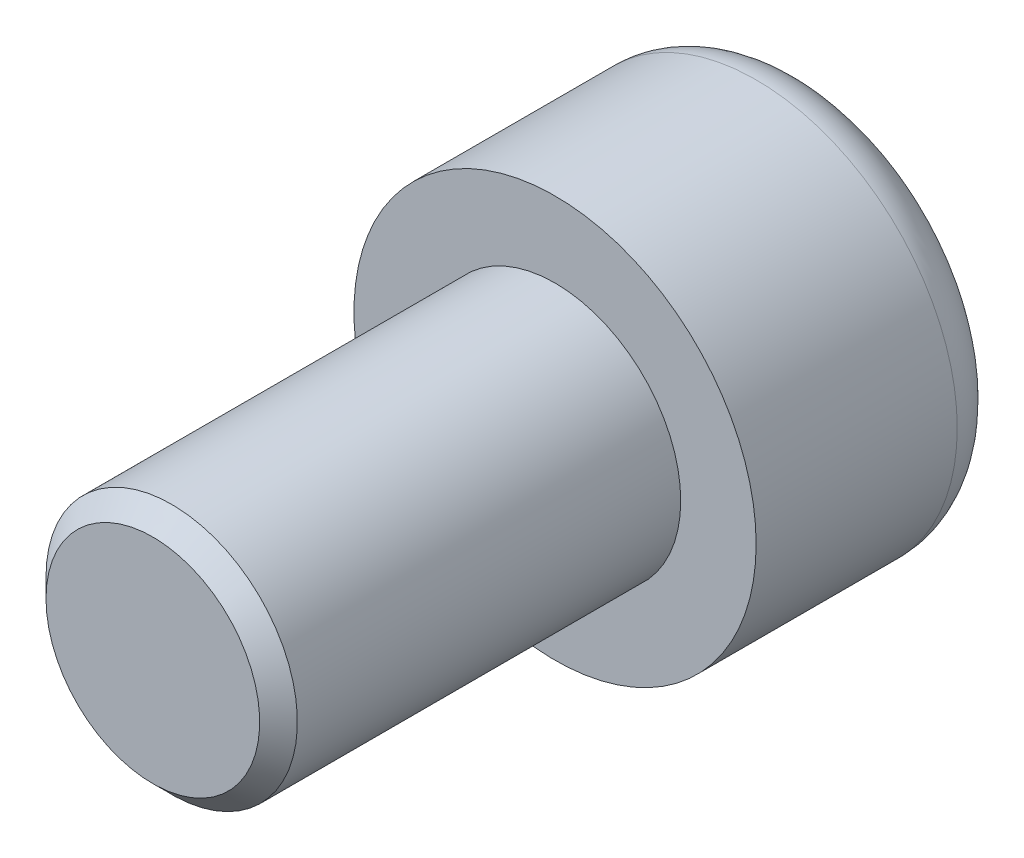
ISO-10303-21;
HEADER;
FILE_DESCRIPTION(('STEP AP214'),'2;1');
FILE_NAME('part.step','',(''),(''),'','','');
FILE_SCHEMA(('AUTOMOTIVE_DESIGN { 1 0 10303 214 1 1 1 1 }'));
ENDSEC;
DATA;
#1=APPLICATION_CONTEXT('core data for automotive mechanical design processes');
#2=APPLICATION_PROTOCOL_DEFINITION('international standard','automotive_design',2000,#1);
#3=PRODUCT_CONTEXT('',#1,'mechanical');
#4=PRODUCT('Part','Part','',(#3));
#5=PRODUCT_RELATED_PRODUCT_CATEGORY('part','',(#4));
#6=PRODUCT_DEFINITION_FORMATION('','',#4);
#7=PRODUCT_DEFINITION_CONTEXT('part definition',#1,'design');
#8=PRODUCT_DEFINITION('design','',#6,#7);
#9=PRODUCT_DEFINITION_SHAPE('','',#8);
#10=(LENGTH_UNIT() NAMED_UNIT(*) SI_UNIT(.MILLI.,.METRE.));
#11=(NAMED_UNIT(*) PLANE_ANGLE_UNIT() SI_UNIT($,.RADIAN.));
#12=(NAMED_UNIT(*) SI_UNIT($,.STERADIAN.) SOLID_ANGLE_UNIT());
#13=UNCERTAINTY_MEASURE_WITH_UNIT(LENGTH_MEASURE(1.E-05),#10,'distance_accuracy_value','');
#14=(GEOMETRIC_REPRESENTATION_CONTEXT(3) GLOBAL_UNCERTAINTY_ASSIGNED_CONTEXT((#13)) GLOBAL_UNIT_ASSIGNED_CONTEXT((#10,
#11,#12)) REPRESENTATION_CONTEXT('',''));
#15=CARTESIAN_POINT('',(0.,0.,0.));
#16=DIRECTION('',(0.,0.,1.));
#17=DIRECTION('',(1.,0.,0.));
#18=AXIS2_PLACEMENT_3D('',#15,#16,#17);
#19=CARTESIAN_POINT('',(0.,0.,10.));
#20=DIRECTION('',(0.,0.,1.));
#21=DIRECTION('',(1.,0.,0.));
#22=AXIS2_PLACEMENT_3D('',#19,#20,#21);
#23=PLANE('',#22);
#24=CARTESIAN_POINT('',(0.,0.,10.));
#25=DIRECTION('',(0.,0.,1.));
#26=DIRECTION('',(1.,0.,0.));
#27=AXIS2_PLACEMENT_3D('',#24,#25,#26);
#28=CIRCLE('',#27,8.);
#29=CARTESIAN_POINT('',(8.,0.,10.));
#30=VERTEX_POINT('',#29);
#31=EDGE_CURVE('E136',#30,#30,#28,.T.);
#32=ORIENTED_EDGE('',*,*,#31,.T.);
#33=EDGE_LOOP('',(#32));
#34=FACE_BOUND('',#33,.T.);
#35=CARTESIAN_POINT('',(0.,0.,10.));
#36=DIRECTION('',(0.,0.,1.));
#37=DIRECTION('',(1.,0.,0.));
#38=AXIS2_PLACEMENT_3D('',#35,#36,#37);
#39=CIRCLE('',#38,5.);
#40=CARTESIAN_POINT('',(5.,0.,10.));
#41=VERTEX_POINT('',#40);
#42=EDGE_CURVE('E123',#41,#41,#39,.T.);
#43=ORIENTED_EDGE('',*,*,#42,.F.);
#44=EDGE_LOOP('',(#43));
#45=FACE_BOUND('',#44,.T.);
#46=ADVANCED_FACE('F33',(#34,#45),#23,.T.);
#47=CARTESIAN_POINT('',(0.,0.,10.));
#48=DIRECTION('',(0.,0.,-1.));
#49=DIRECTION('',(-1.,0.,0.));
#50=AXIS2_PLACEMENT_3D('',#47,#48,#49);
#51=CYLINDRICAL_SURFACE('',#50,8.);
#52=CARTESIAN_POINT('',(0.,0.,2.));
#53=DIRECTION('',(0.,0.,1.));
#54=DIRECTION('',(1.,0.,0.));
#55=AXIS2_PLACEMENT_3D('',#52,#53,#54);
#56=CIRCLE('',#55,8.);
#57=CARTESIAN_POINT('',(8.,0.,2.));
#58=VERTEX_POINT('',#57);
#59=EDGE_CURVE('E41',#58,#58,#56,.T.);
#60=ORIENTED_EDGE('',*,*,#59,.T.);
#61=EDGE_LOOP('',(#60));
#62=FACE_BOUND('',#61,.T.);
#63=ORIENTED_EDGE('',*,*,#31,.F.);
#64=EDGE_LOOP('',(#63));
#65=FACE_BOUND('',#64,.T.);
#66=ADVANCED_FACE('F146',(#62,#65),#51,.T.);
#67=CARTESIAN_POINT('',(0.,0.,0.));
#68=DIRECTION('',(0.,0.,1.));
#69=DIRECTION('',(1.,0.,0.));
#70=AXIS2_PLACEMENT_3D('',#67,#68,#69);
#71=PLANE('',#70);
#72=CARTESIAN_POINT('',(0.,0.,0.));
#73=DIRECTION('',(0.,0.,1.));
#74=DIRECTION('',(1.,0.,0.));
#75=AXIS2_PLACEMENT_3D('',#72,#73,#74);
#76=CIRCLE('',#75,6.);
#77=CARTESIAN_POINT('',(6.,0.,0.));
#78=VERTEX_POINT('',#77);
#79=EDGE_CURVE('E11',#78,#78,#76,.F.);
#80=ORIENTED_EDGE('',*,*,#79,.T.);
#81=EDGE_LOOP('',(#80));
#82=FACE_BOUND('',#81,.T.);
#83=DIRECTION('',(0.866025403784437,-0.500000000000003,0.));
#84=VECTOR('',#83,1.);
#85=CARTESIAN_POINT('',(0.,4.61880215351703,0.));
#86=LINE('',#85,#84);
#87=CARTESIAN_POINT('',(0.,4.61880215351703,0.));
#88=VERTEX_POINT('',#87);
#89=CARTESIAN_POINT('',(4.,2.30940107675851,0.));
#90=VERTEX_POINT('',#89);
#91=EDGE_CURVE('E122',#88,#90,#86,.T.);
#92=ORIENTED_EDGE('',*,*,#91,.F.);
#93=DIRECTION('',(0.866025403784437,0.500000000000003,0.));
#94=VECTOR('',#93,1.);
#95=CARTESIAN_POINT('',(0.,4.61880215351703,0.));
#96=LINE('',#95,#94);
#97=CARTESIAN_POINT('',(-4.,2.30940107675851,0.));
#98=VERTEX_POINT('',#97);
#99=EDGE_CURVE('E48',#98,#88,#96,.T.);
#100=ORIENTED_EDGE('',*,*,#99,.F.);
#101=DIRECTION('',(0.,1.,0.));
#102=VECTOR('',#101,1.);
#103=CARTESIAN_POINT('',(-4.,2.30940107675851,0.));
#104=LINE('',#103,#102);
#105=CARTESIAN_POINT('',(-4.,-2.30940107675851,0.));
#106=VERTEX_POINT('',#105);
#107=EDGE_CURVE('E132',#106,#98,#104,.T.);
#108=ORIENTED_EDGE('',*,*,#107,.F.);
#109=DIRECTION('',(-0.866025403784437,0.500000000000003,0.));
#110=VECTOR('',#109,1.);
#111=CARTESIAN_POINT('',(-4.,-2.30940107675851,0.));
#112=LINE('',#111,#110);
#113=CARTESIAN_POINT('',(0.,-4.61880215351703,0.));
#114=VERTEX_POINT('',#113);
#115=EDGE_CURVE('E130',#114,#106,#112,.T.);
#116=ORIENTED_EDGE('',*,*,#115,.F.);
#117=DIRECTION('',(-0.866025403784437,-0.500000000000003,0.));
#118=VECTOR('',#117,1.);
#119=CARTESIAN_POINT('',(4.,-2.30940107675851,0.));
#120=LINE('',#119,#118);
#121=CARTESIAN_POINT('',(4.,-2.30940107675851,0.));
#122=VERTEX_POINT('',#121);
#123=EDGE_CURVE('E96',#122,#114,#120,.T.);
#124=ORIENTED_EDGE('',*,*,#123,.F.);
#125=DIRECTION('',(0.,-1.,0.));
#126=VECTOR('',#125,1.);
#127=CARTESIAN_POINT('',(4.,2.30940107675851,0.));
#128=LINE('',#127,#126);
#129=EDGE_CURVE('E126',#90,#122,#128,.T.);
#130=ORIENTED_EDGE('',*,*,#129,.F.);
#131=EDGE_LOOP('',(#92,#100,#108,#116,#124,#130));
#132=FACE_BOUND('',#131,.T.);
#133=ADVANCED_FACE('F168',(#82,#132),#71,.F.);
#134=CARTESIAN_POINT('',(0.,4.61880215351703,6.25));
#135=DIRECTION('',(-0.500000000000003,0.866025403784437,0.));
#136=DIRECTION('',(-0.866025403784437,-0.500000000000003,0.));
#137=AXIS2_PLACEMENT_3D('',#134,#135,#136);
#138=PLANE('',#137);
#139=ORIENTED_EDGE('',*,*,#99,.T.);
#140=DIRECTION('',(0.,0.,-1.));
#141=VECTOR('',#140,1.);
#142=CARTESIAN_POINT('',(0.,4.61880215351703,6.25));
#143=LINE('',#142,#141);
#144=CARTESIAN_POINT('',(0.,4.61880215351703,6.25));
#145=VERTEX_POINT('',#144);
#146=EDGE_CURVE('E78',#145,#88,#143,.T.);
#147=ORIENTED_EDGE('',*,*,#146,.F.);
#148=DIRECTION('',(0.866025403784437,0.500000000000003,0.));
#149=VECTOR('',#148,1.);
#150=CARTESIAN_POINT('',(0.,4.61880215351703,6.25));
#151=LINE('',#150,#149);
#152=CARTESIAN_POINT('',(-4.,2.30940107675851,6.25));
#153=VERTEX_POINT('',#152);
#154=EDGE_CURVE('E134',#153,#145,#151,.T.);
#155=ORIENTED_EDGE('',*,*,#154,.F.);
#156=DIRECTION('',(0.,0.,-1.));
#157=VECTOR('',#156,1.);
#158=CARTESIAN_POINT('',(-4.,2.30940107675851,6.25));
#159=LINE('',#158,#157);
#160=EDGE_CURVE('E56',#153,#98,#159,.T.);
#161=ORIENTED_EDGE('',*,*,#160,.T.);
#162=EDGE_LOOP('',(#139,#147,#155,#161));
#163=FACE_BOUND('',#162,.T.);
#164=ADVANCED_FACE('F172',(#163),#138,.F.);
#165=CARTESIAN_POINT('',(-4.,2.30940107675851,6.25));
#166=DIRECTION('',(-1.,0.,0.));
#167=DIRECTION('',(0.,0.,1.));
#168=AXIS2_PLACEMENT_3D('',#165,#166,#167);
#169=PLANE('',#168);
#170=ORIENTED_EDGE('',*,*,#107,.T.);
#171=ORIENTED_EDGE('',*,*,#160,.F.);
#172=DIRECTION('',(0.,1.,0.));
#173=VECTOR('',#172,1.);
#174=CARTESIAN_POINT('',(-4.,2.30940107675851,6.25));
#175=LINE('',#174,#173);
#176=CARTESIAN_POINT('',(-4.,-2.30940107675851,6.25));
#177=VERTEX_POINT('',#176);
#178=EDGE_CURVE('E108',#177,#153,#175,.T.);
#179=ORIENTED_EDGE('',*,*,#178,.F.);
#180=DIRECTION('',(0.,0.,-1.));
#181=VECTOR('',#180,1.);
#182=CARTESIAN_POINT('',(-4.,-2.30940107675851,6.25));
#183=LINE('',#182,#181);
#184=EDGE_CURVE('E100',#177,#106,#183,.T.);
#185=ORIENTED_EDGE('',*,*,#184,.T.);
#186=EDGE_LOOP('',(#170,#171,#179,#185));
#187=FACE_BOUND('',#186,.T.);
#188=ADVANCED_FACE('F179',(#187),#169,.F.);
#189=CARTESIAN_POINT('',(-4.,-2.30940107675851,6.25));
#190=DIRECTION('',(-0.500000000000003,-0.866025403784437,0.));
#191=DIRECTION('',(0.866025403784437,-0.500000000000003,0.));
#192=AXIS2_PLACEMENT_3D('',#189,#190,#191);
#193=PLANE('',#192);
#194=ORIENTED_EDGE('',*,*,#115,.T.);
#195=ORIENTED_EDGE('',*,*,#184,.F.);
#196=DIRECTION('',(-0.866025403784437,0.500000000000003,0.));
#197=VECTOR('',#196,1.);
#198=CARTESIAN_POINT('',(-4.,-2.30940107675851,6.25));
#199=LINE('',#198,#197);
#200=CARTESIAN_POINT('',(0.,-4.61880215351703,6.25));
#201=VERTEX_POINT('',#200);
#202=EDGE_CURVE('E104',#201,#177,#199,.T.);
#203=ORIENTED_EDGE('',*,*,#202,.F.);
#204=DIRECTION('',(0.,0.,-1.));
#205=VECTOR('',#204,1.);
#206=CARTESIAN_POINT('',(0.,-4.61880215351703,6.25));
#207=LINE('',#206,#205);
#208=EDGE_CURVE('E89',#201,#114,#207,.T.);
#209=ORIENTED_EDGE('',*,*,#208,.T.);
#210=EDGE_LOOP('',(#194,#195,#203,#209));
#211=FACE_BOUND('',#210,.T.);
#212=ADVANCED_FACE('F105',(#211),#193,.F.);
#213=CARTESIAN_POINT('',(4.,-2.30940107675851,6.25));
#214=DIRECTION('',(0.500000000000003,-0.866025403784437,0.));
#215=DIRECTION('',(0.866025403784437,0.500000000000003,0.));
#216=AXIS2_PLACEMENT_3D('',#213,#214,#215);
#217=PLANE('',#216);
#218=ORIENTED_EDGE('',*,*,#123,.T.);
#219=ORIENTED_EDGE('',*,*,#208,.F.);
#220=DIRECTION('',(-0.866025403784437,-0.500000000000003,0.));
#221=VECTOR('',#220,1.);
#222=CARTESIAN_POINT('',(4.,-2.30940107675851,6.25));
#223=LINE('',#222,#221);
#224=CARTESIAN_POINT('',(4.,-2.30940107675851,6.25));
#225=VERTEX_POINT('',#224);
#226=EDGE_CURVE('E93',#225,#201,#223,.T.);
#227=ORIENTED_EDGE('',*,*,#226,.F.);
#228=DIRECTION('',(0.,0.,-1.));
#229=VECTOR('',#228,1.);
#230=CARTESIAN_POINT('',(4.,-2.30940107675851,6.25));
#231=LINE('',#230,#229);
#232=EDGE_CURVE('E101',#225,#122,#231,.T.);
#233=ORIENTED_EDGE('',*,*,#232,.T.);
#234=EDGE_LOOP('',(#218,#219,#227,#233));
#235=FACE_BOUND('',#234,.T.);
#236=ADVANCED_FACE('F91',(#235),#217,.F.);
#237=CARTESIAN_POINT('',(4.,2.30940107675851,6.25));
#238=DIRECTION('',(1.,0.,0.));
#239=DIRECTION('',(0.,0.,-1.));
#240=AXIS2_PLACEMENT_3D('',#237,#238,#239);
#241=PLANE('',#240);
#242=ORIENTED_EDGE('',*,*,#129,.T.);
#243=ORIENTED_EDGE('',*,*,#232,.F.);
#244=DIRECTION('',(0.,-1.,0.));
#245=VECTOR('',#244,1.);
#246=CARTESIAN_POINT('',(4.,2.30940107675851,6.25));
#247=LINE('',#246,#245);
#248=CARTESIAN_POINT('',(4.,2.30940107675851,6.25));
#249=VERTEX_POINT('',#248);
#250=EDGE_CURVE('E114',#249,#225,#247,.T.);
#251=ORIENTED_EDGE('',*,*,#250,.F.);
#252=DIRECTION('',(0.,0.,-1.));
#253=VECTOR('',#252,1.);
#254=CARTESIAN_POINT('',(4.,2.30940107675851,6.25));
#255=LINE('',#254,#253);
#256=EDGE_CURVE('E139',#249,#90,#255,.T.);
#257=ORIENTED_EDGE('',*,*,#256,.T.);
#258=EDGE_LOOP('',(#242,#243,#251,#257));
#259=FACE_BOUND('',#258,.T.);
#260=ADVANCED_FACE('F214',(#259),#241,.F.);
#261=CARTESIAN_POINT('',(0.,4.61880215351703,6.25));
#262=DIRECTION('',(0.500000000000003,0.866025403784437,0.));
#263=DIRECTION('',(-0.866025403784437,0.500000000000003,0.));
#264=AXIS2_PLACEMENT_3D('',#261,#262,#263);
#265=PLANE('',#264);
#266=ORIENTED_EDGE('',*,*,#91,.T.);
#267=ORIENTED_EDGE('',*,*,#256,.F.);
#268=DIRECTION('',(0.866025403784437,-0.500000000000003,0.));
#269=VECTOR('',#268,1.);
#270=CARTESIAN_POINT('',(0.,4.61880215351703,6.25));
#271=LINE('',#270,#269);
#272=EDGE_CURVE('E116',#145,#249,#271,.T.);
#273=ORIENTED_EDGE('',*,*,#272,.F.);
#274=ORIENTED_EDGE('',*,*,#146,.T.);
#275=EDGE_LOOP('',(#266,#267,#273,#274));
#276=FACE_BOUND('',#275,.T.);
#277=ADVANCED_FACE('F159',(#276),#265,.F.);
#278=CARTESIAN_POINT('',(-7.99999999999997,0.,6.25));
#279=DIRECTION('',(0.,0.,1.));
#280=DIRECTION('',(1.,0.,0.));
#281=AXIS2_PLACEMENT_3D('',#278,#279,#280);
#282=PLANE('',#281);
#283=ORIENTED_EDGE('',*,*,#154,.T.);
#284=ORIENTED_EDGE('',*,*,#272,.T.);
#285=ORIENTED_EDGE('',*,*,#250,.T.);
#286=ORIENTED_EDGE('',*,*,#226,.T.);
#287=ORIENTED_EDGE('',*,*,#202,.T.);
#288=ORIENTED_EDGE('',*,*,#178,.T.);
#289=EDGE_LOOP('',(#283,#284,#285,#286,#287,#288));
#290=FACE_BOUND('',#289,.T.);
#291=ADVANCED_FACE('F111',(#290),#282,.F.);
#292=CARTESIAN_POINT('',(0.,0.,2.));
#293=DIRECTION('',(0.,0.,1.));
#294=DIRECTION('',(1.,0.,0.));
#295=AXIS2_PLACEMENT_3D('',#292,#293,#294);
#296=TOROIDAL_SURFACE('',#295,6.,2.);
#297=ORIENTED_EDGE('',*,*,#79,.F.);
#298=EDGE_LOOP('',(#297));
#299=FACE_BOUND('',#298,.T.);
#300=ORIENTED_EDGE('',*,*,#59,.F.);
#301=EDGE_LOOP('',(#300));
#302=FACE_BOUND('',#301,.T.);
#303=ADVANCED_FACE('F35',(#299,#302),#296,.T.);
#304=CARTESIAN_POINT('',(0.,0.,26.));
#305=DIRECTION('',(0.,0.,-1.));
#306=DIRECTION('',(-1.,0.,0.));
#307=AXIS2_PLACEMENT_3D('',#304,#305,#306);
#308=CYLINDRICAL_SURFACE('',#307,5.);
#309=CARTESIAN_POINT('',(0.,0.,25.2499999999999));
#310=DIRECTION('',(0.,0.,-1.));
#311=DIRECTION('',(-1.,0.,0.));
#312=AXIS2_PLACEMENT_3D('',#309,#310,#311);
#313=CIRCLE('',#312,5.);
#314=CARTESIAN_POINT('',(-5.,0.,25.2499999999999));
#315=VERTEX_POINT('',#314);
#316=EDGE_CURVE('E192',#315,#315,#313,.T.);
#317=ORIENTED_EDGE('',*,*,#316,.T.);
#318=EDGE_LOOP('',(#317));
#319=FACE_BOUND('',#318,.T.);
#320=ORIENTED_EDGE('',*,*,#42,.T.);
#321=EDGE_LOOP('',(#320));
#322=FACE_BOUND('',#321,.T.);
#323=ADVANCED_FACE('F150',(#319,#322),#308,.T.);
#324=CARTESIAN_POINT('',(0.,0.,26.));
#325=DIRECTION('',(0.,0.,-1.));
#326=DIRECTION('',(-1.,0.,0.));
#327=AXIS2_PLACEMENT_3D('',#324,#325,#326);
#328=CONICAL_SURFACE('',#327,4.24999999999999,0.785398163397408);
#329=ORIENTED_EDGE('',*,*,#316,.F.);
#330=EDGE_LOOP('',(#329));
#331=FACE_BOUND('',#330,.T.);
#332=CARTESIAN_POINT('',(0.,0.,26.));
#333=DIRECTION('',(0.,0.,-1.));
#334=DIRECTION('',(-1.,0.,0.));
#335=AXIS2_PLACEMENT_3D('',#332,#333,#334);
#336=CIRCLE('',#335,4.24999999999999);
#337=CARTESIAN_POINT('',(-4.24999999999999,0.,26.));
#338=VERTEX_POINT('',#337);
#339=EDGE_CURVE('E189',#338,#338,#336,.T.);
#340=ORIENTED_EDGE('',*,*,#339,.T.);
#341=EDGE_LOOP('',(#340));
#342=FACE_BOUND('',#341,.T.);
#343=ADVANCED_FACE('F156',(#331,#342),#328,.T.);
#344=CARTESIAN_POINT('',(0.,0.,26.));
#345=DIRECTION('',(0.,0.,1.));
#346=DIRECTION('',(1.,0.,0.));
#347=AXIS2_PLACEMENT_3D('',#344,#345,#346);
#348=PLANE('',#347);
#349=ORIENTED_EDGE('',*,*,#339,.F.);
#350=EDGE_LOOP('',(#349));
#351=FACE_BOUND('',#350,.T.);
#352=ADVANCED_FACE('F199',(#351),#348,.T.);
#353=CLOSED_SHELL('',(#46,#66,#133,#164,#188,#212,#236,#260,#277,#291,#303,#323,#343,#352));
#354=MANIFOLD_SOLID_BREP('B2',#353);
#355=ADVANCED_BREP_SHAPE_REPRESENTATION('',(#18,#354),#14);
#356=SHAPE_DEFINITION_REPRESENTATION(#9,#355);
ENDSEC;
END-ISO-10303-21;
